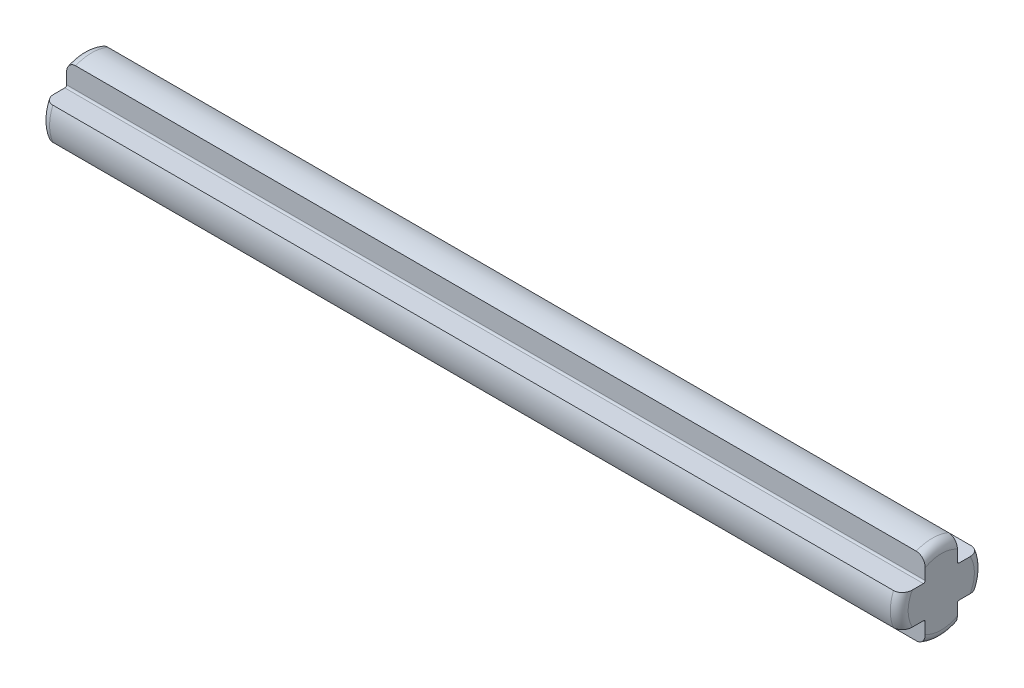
ISO-10303-21;
HEADER;
FILE_DESCRIPTION(('STEP AP214'),'2;1');
FILE_NAME('part.step','',(''),(''),'','','');
FILE_SCHEMA(('AUTOMOTIVE_DESIGN { 1 0 10303 214 1 1 1 1 }'));
ENDSEC;
DATA;
#1=APPLICATION_CONTEXT('core data for automotive mechanical design processes');
#2=APPLICATION_PROTOCOL_DEFINITION('international standard','automotive_design',2000,#1);
#3=PRODUCT_CONTEXT('',#1,'mechanical');
#4=PRODUCT('Part','Part','',(#3));
#5=PRODUCT_RELATED_PRODUCT_CATEGORY('part','',(#4));
#6=PRODUCT_DEFINITION_FORMATION('','',#4);
#7=PRODUCT_DEFINITION_CONTEXT('part definition',#1,'design');
#8=PRODUCT_DEFINITION('design','',#6,#7);
#9=PRODUCT_DEFINITION_SHAPE('','',#8);
#10=(LENGTH_UNIT() NAMED_UNIT(*) SI_UNIT(.MILLI.,.METRE.));
#11=(NAMED_UNIT(*) PLANE_ANGLE_UNIT() SI_UNIT($,.RADIAN.));
#12=(NAMED_UNIT(*) SI_UNIT($,.STERADIAN.) SOLID_ANGLE_UNIT());
#13=UNCERTAINTY_MEASURE_WITH_UNIT(LENGTH_MEASURE(1.E-05),#10,'distance_accuracy_value','');
#14=(GEOMETRIC_REPRESENTATION_CONTEXT(3) GLOBAL_UNCERTAINTY_ASSIGNED_CONTEXT((#13)) GLOBAL_UNIT_ASSIGNED_CONTEXT((#10,
#11,#12)) REPRESENTATION_CONTEXT('',''));
#15=CARTESIAN_POINT('',(0.,0.,0.));
#16=DIRECTION('',(0.,0.,1.));
#17=DIRECTION('',(1.,0.,0.));
#18=AXIS2_PLACEMENT_3D('',#15,#16,#17);
#19=CARTESIAN_POINT('',(24.,0.,0.));
#20=DIRECTION('',(-1.,0.,0.));
#21=DIRECTION('',(0.,0.,1.));
#22=AXIS2_PLACEMENT_3D('',#19,#20,#21);
#23=CYLINDRICAL_SURFACE('',#22,2.35);
#24=DIRECTION('',(-1.,0.,0.));
#25=VECTOR('',#24,1.);
#26=CARTESIAN_POINT('',(24.,0.9,2.17082933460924));
#27=LINE('',#26,#25);
#28=CARTESIAN_POINT('',(23.5,0.9,2.17082933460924));
#29=VERTEX_POINT('',#28);
#30=CARTESIAN_POINT('',(-23.5,0.9,2.17082933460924));
#31=VERTEX_POINT('',#30);
#32=EDGE_CURVE('E250',#29,#31,#27,.T.);
#33=ORIENTED_EDGE('',*,*,#32,.T.);
#34=CARTESIAN_POINT('',(-23.5,0.,0.));
#35=DIRECTION('',(1.,0.,0.));
#36=DIRECTION('',(0.,0.,-1.));
#37=AXIS2_PLACEMENT_3D('',#34,#35,#36);
#38=CIRCLE('',#37,2.35);
#39=CARTESIAN_POINT('',(-23.5,-0.900000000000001,2.17082933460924));
#40=VERTEX_POINT('',#39);
#41=EDGE_CURVE('E515',#31,#40,#38,.T.);
#42=ORIENTED_EDGE('',*,*,#41,.T.);
#43=DIRECTION('',(-1.,0.,0.));
#44=VECTOR('',#43,1.);
#45=CARTESIAN_POINT('',(24.,-0.900000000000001,2.17082933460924));
#46=LINE('',#45,#44);
#47=CARTESIAN_POINT('',(23.5,-0.900000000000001,2.17082933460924));
#48=VERTEX_POINT('',#47);
#49=EDGE_CURVE('E221',#48,#40,#46,.T.);
#50=ORIENTED_EDGE('',*,*,#49,.F.);
#51=CARTESIAN_POINT('',(23.5,0.,0.));
#52=DIRECTION('',(1.,0.,0.));
#53=DIRECTION('',(0.,0.,-1.));
#54=AXIS2_PLACEMENT_3D('',#51,#52,#53);
#55=CIRCLE('',#54,2.35);
#56=EDGE_CURVE('E370',#48,#29,#55,.F.);
#57=ORIENTED_EDGE('',*,*,#56,.T.);
#58=EDGE_LOOP('',(#33,#42,#50,#57));
#59=FACE_BOUND('',#58,.T.);
#60=ADVANCED_FACE('F37',(#59),#23,.T.);
#61=CARTESIAN_POINT('',(24.,-0.900000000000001,2.17082933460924));
#62=DIRECTION('',(0.,1.,0.));
#63=DIRECTION('',(0.,0.,1.));
#64=AXIS2_PLACEMENT_3D('',#61,#62,#63);
#65=PLANE('',#64);
#66=ORIENTED_EDGE('',*,*,#49,.T.);
#67=CARTESIAN_POINT('',(-23.5,-0.900000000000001,2.17082933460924));
#68=CARTESIAN_POINT('',(-23.5264833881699,-0.900000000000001,2.17085986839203));
#69=CARTESIAN_POINT('',(-23.5529498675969,-0.900000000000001,2.16855372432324));
#70=CARTESIAN_POINT('',(-23.6050453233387,-0.900000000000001,2.15950506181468));
#71=CARTESIAN_POINT('',(-23.6306762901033,-0.900000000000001,2.15277404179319));
#72=CARTESIAN_POINT('',(-23.6804387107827,-0.900000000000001,2.1351114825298));
#73=CARTESIAN_POINT('',(-23.7045703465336,-0.900000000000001,2.12418045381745));
#74=CARTESIAN_POINT('',(-23.7507251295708,-0.900000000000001,2.09852306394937));
#75=CARTESIAN_POINT('',(-23.7727475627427,-0.900000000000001,2.0837954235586));
#76=CARTESIAN_POINT('',(-23.8147234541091,-0.900000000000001,2.05060839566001));
#77=CARTESIAN_POINT('',(-23.8346070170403,-0.900000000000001,2.03206082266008));
#78=CARTESIAN_POINT('',(-23.8712243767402,-0.900000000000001,1.99209288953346));
#79=CARTESIAN_POINT('',(-23.8879579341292,-0.900000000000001,1.97067231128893));
#80=CARTESIAN_POINT('',(-23.9190973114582,-0.900000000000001,1.92396602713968));
#81=CARTESIAN_POINT('',(-23.9332527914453,-0.900000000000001,1.89851375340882));
#82=CARTESIAN_POINT('',(-23.9575247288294,-0.900000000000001,1.84573102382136));
#83=CARTESIAN_POINT('',(-23.9676367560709,-0.900000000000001,1.81839854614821));
#84=CARTESIAN_POINT('',(-23.9838866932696,-0.900000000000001,1.76219756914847));
#85=CARTESIAN_POINT('',(-23.9899702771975,-0.900000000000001,1.73331353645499));
#86=CARTESIAN_POINT('',(-23.9980270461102,-0.900000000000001,1.67505065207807));
#87=CARTESIAN_POINT('',(-24.0000109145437,-0.900000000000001,1.64567328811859));
#88=CARTESIAN_POINT('',(-24.,-0.900000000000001,1.61632298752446));
#89=B_SPLINE_CURVE_WITH_KNOTS('',3,(#67,#68,#69,#70,#71,#72,#73,#74,#75,#76,#77,#78,#79,#80,#81,
#82,#83,#84,#85,#86,#87,#88),.UNSPECIFIED.,.F.,.F.,(4,2,2,2,2,2,2,2,2,2,4),(0.,
0.0793238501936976,0.158442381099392,0.237551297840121,0.316686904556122,0.397909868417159,
0.479139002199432,0.566147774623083,0.653251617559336,0.741507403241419,0.829532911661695),.UNSPECIFIED.);
#90=CARTESIAN_POINT('',(-24.,-0.900000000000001,1.61632298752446));
#91=VERTEX_POINT('',#90);
#92=EDGE_CURVE('E390',#40,#91,#89,.T.);
#93=ORIENTED_EDGE('',*,*,#92,.T.);
#94=DIRECTION('',(0.,0.,-1.));
#95=VECTOR('',#94,1.);
#96=CARTESIAN_POINT('',(-24.,-0.900000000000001,2.17082933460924));
#97=LINE('',#96,#95);
#98=CARTESIAN_POINT('',(-24.,-0.900000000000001,0.999999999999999));
#99=VERTEX_POINT('',#98);
#100=EDGE_CURVE('E218',#91,#99,#97,.T.);
#101=ORIENTED_EDGE('',*,*,#100,.T.);
#102=DIRECTION('',(-1.,0.,0.));
#103=VECTOR('',#102,1.);
#104=CARTESIAN_POINT('',(24.,-0.900000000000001,0.999999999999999));
#105=LINE('',#104,#103);
#106=CARTESIAN_POINT('',(24.,-0.900000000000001,0.999999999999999));
#107=VERTEX_POINT('',#106);
#108=EDGE_CURVE('E214',#107,#99,#105,.T.);
#109=ORIENTED_EDGE('',*,*,#108,.F.);
#110=DIRECTION('',(0.,0.,-1.));
#111=VECTOR('',#110,1.);
#112=CARTESIAN_POINT('',(24.,-0.900000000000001,2.17082933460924));
#113=LINE('',#112,#111);
#114=CARTESIAN_POINT('',(24.,-0.900000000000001,1.61632298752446));
#115=VERTEX_POINT('',#114);
#116=EDGE_CURVE('E201',#115,#107,#113,.T.);
#117=ORIENTED_EDGE('',*,*,#116,.F.);
#118=CARTESIAN_POINT('',(24.,-0.900000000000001,1.61632298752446));
#119=CARTESIAN_POINT('',(24.0000222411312,-0.900000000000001,1.65066661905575));
#120=CARTESIAN_POINT('',(23.9972983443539,-0.900000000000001,1.68506058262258));
#121=CARTESIAN_POINT('',(23.9862156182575,-0.900000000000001,1.75308687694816));
#122=CARTESIAN_POINT('',(23.9778303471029,-0.900000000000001,1.78671486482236));
#123=CARTESIAN_POINT('',(23.9552419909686,-0.900000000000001,1.85211366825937));
#124=CARTESIAN_POINT('',(23.9410195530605,-0.900000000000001,1.88387790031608));
#125=CARTESIAN_POINT('',(23.9069131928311,-0.900000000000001,1.94414749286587));
#126=CARTESIAN_POINT('',(23.8870416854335,-0.900000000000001,1.97265980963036));
#127=CARTESIAN_POINT('',(23.844222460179,-0.900000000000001,2.02268935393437));
#128=CARTESIAN_POINT('',(23.8217526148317,-0.900000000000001,2.04461521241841));
#129=CARTESIAN_POINT('',(23.7730890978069,-0.900000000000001,2.08389547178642));
#130=CARTESIAN_POINT('',(23.7468952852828,-0.900000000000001,2.10124969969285));
#131=CARTESIAN_POINT('',(23.6943438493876,-0.900000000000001,2.12912089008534));
#132=CARTESIAN_POINT('',(23.6682509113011,-0.900000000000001,2.14013932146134));
#133=CARTESIAN_POINT('',(23.6145341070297,-0.900000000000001,2.15730052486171));
#134=CARTESIAN_POINT('',(23.586913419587,-0.900000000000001,2.1634530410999));
#135=CARTESIAN_POINT('',(23.5492135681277,-0.900000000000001,2.16830749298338));
#136=CARTESIAN_POINT('',(23.5393866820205,-0.900000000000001,2.1692533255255));
#137=CARTESIAN_POINT('',(23.5197081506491,-0.900000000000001,2.17051341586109));
#138=CARTESIAN_POINT('',(23.5098565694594,-0.900000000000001,2.17082867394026));
#139=CARTESIAN_POINT('',(23.5,-0.900000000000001,2.17082933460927));
#140=B_SPLINE_CURVE_WITH_KNOTS('',3,(#118,#119,#120,#121,#122,#123,#124,#125,#126,#127,#128,
#129,#130,#131,#132,#133,#134,#135,#136,#137,#138,#139),.UNSPECIFIED.,.F.,.F.,(4,2,2,2,2,2,2,2,
2,2,4),(0.,0.10300027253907,0.206484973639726,0.31031558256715,0.413919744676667,
0.507586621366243,0.60125704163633,0.685799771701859,0.770172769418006,0.79977449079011,
0.829329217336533),.UNSPECIFIED.);
#141=EDGE_CURVE('E520',#115,#48,#140,.T.);
#142=ORIENTED_EDGE('',*,*,#141,.T.);
#143=EDGE_LOOP('',(#66,#93,#101,#109,#117,#142));
#144=FACE_BOUND('',#143,.T.);
#145=ADVANCED_FACE('F216',(#144),#65,.F.);
#146=CARTESIAN_POINT('',(24.,-1.,0.999999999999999));
#147=DIRECTION('',(-1.,0.,0.));
#148=DIRECTION('',(0.,0.,1.));
#149=AXIS2_PLACEMENT_3D('',#146,#147,#148);
#150=CYLINDRICAL_SURFACE('',#149,0.0999999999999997);
#151=CARTESIAN_POINT('',(-24.,-1.,0.999999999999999));
#152=DIRECTION('',(-1.,0.,0.));
#153=DIRECTION('',(0.,0.,1.));
#154=AXIS2_PLACEMENT_3D('',#151,#152,#153);
#155=CIRCLE('',#154,0.0999999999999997);
#156=CARTESIAN_POINT('',(-24.,-1.,0.899999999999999));
#157=VERTEX_POINT('',#156);
#158=EDGE_CURVE('E252',#99,#157,#155,.T.);
#159=ORIENTED_EDGE('',*,*,#158,.T.);
#160=DIRECTION('',(-1.,0.,0.));
#161=VECTOR('',#160,1.);
#162=CARTESIAN_POINT('',(24.,-1.,0.899999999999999));
#163=LINE('',#162,#161);
#164=CARTESIAN_POINT('',(24.,-1.,0.899999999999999));
#165=VERTEX_POINT('',#164);
#166=EDGE_CURVE('E222',#165,#157,#163,.T.);
#167=ORIENTED_EDGE('',*,*,#166,.F.);
#168=CARTESIAN_POINT('',(24.,-1.,0.999999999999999));
#169=DIRECTION('',(-1.,0.,0.));
#170=DIRECTION('',(0.,0.,1.));
#171=AXIS2_PLACEMENT_3D('',#168,#169,#170);
#172=CIRCLE('',#171,0.0999999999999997);
#173=EDGE_CURVE('E207',#107,#165,#172,.T.);
#174=ORIENTED_EDGE('',*,*,#173,.F.);
#175=ORIENTED_EDGE('',*,*,#108,.T.);
#176=EDGE_LOOP('',(#159,#167,#174,#175));
#177=FACE_BOUND('',#176,.T.);
#178=ADVANCED_FACE('F224',(#177),#150,.F.);
#179=CARTESIAN_POINT('',(24.,-2.17082933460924,0.899999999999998));
#180=DIRECTION('',(0.,0.,-1.));
#181=DIRECTION('',(0.,1.,0.));
#182=AXIS2_PLACEMENT_3D('',#179,#180,#181);
#183=PLANE('',#182);
#184=DIRECTION('',(0.,-1.,0.));
#185=VECTOR('',#184,1.);
#186=CARTESIAN_POINT('',(-24.,-2.17082933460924,0.899999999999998));
#187=LINE('',#186,#185);
#188=CARTESIAN_POINT('',(-24.,-1.61632298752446,0.899999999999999));
#189=VERTEX_POINT('',#188);
#190=EDGE_CURVE('E254',#157,#189,#187,.T.);
#191=ORIENTED_EDGE('',*,*,#190,.T.);
#192=CARTESIAN_POINT('',(-24.,-1.61632298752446,0.899999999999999));
#193=CARTESIAN_POINT('',(-24.0000222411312,-1.65066661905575,0.899999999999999));
#194=CARTESIAN_POINT('',(-23.9972983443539,-1.68506058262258,0.899999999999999));
#195=CARTESIAN_POINT('',(-23.9862156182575,-1.75308687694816,0.899999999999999));
#196=CARTESIAN_POINT('',(-23.9778303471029,-1.78671486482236,0.899999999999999));
#197=CARTESIAN_POINT('',(-23.9552419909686,-1.85211366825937,0.899999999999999));
#198=CARTESIAN_POINT('',(-23.9410195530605,-1.88387790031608,0.899999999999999));
#199=CARTESIAN_POINT('',(-23.9069131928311,-1.94414749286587,0.899999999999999));
#200=CARTESIAN_POINT('',(-23.8870416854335,-1.97265980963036,0.899999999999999));
#201=CARTESIAN_POINT('',(-23.844222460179,-2.02268935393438,0.899999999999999));
#202=CARTESIAN_POINT('',(-23.8217526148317,-2.04461521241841,0.899999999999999));
#203=CARTESIAN_POINT('',(-23.7730890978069,-2.08389547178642,0.899999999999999));
#204=CARTESIAN_POINT('',(-23.7468952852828,-2.10124969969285,0.899999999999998));
#205=CARTESIAN_POINT('',(-23.6943438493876,-2.12912089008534,0.899999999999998));
#206=CARTESIAN_POINT('',(-23.6682509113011,-2.14013932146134,0.899999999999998));
#207=CARTESIAN_POINT('',(-23.6145341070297,-2.15730052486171,0.899999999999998));
#208=CARTESIAN_POINT('',(-23.586913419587,-2.1634530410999,0.899999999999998));
#209=CARTESIAN_POINT('',(-23.5492135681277,-2.16830749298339,0.899999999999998));
#210=CARTESIAN_POINT('',(-23.5393866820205,-2.1692533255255,0.899999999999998));
#211=CARTESIAN_POINT('',(-23.5197081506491,-2.17051341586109,0.899999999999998));
#212=CARTESIAN_POINT('',(-23.5098565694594,-2.17082867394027,0.899999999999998));
#213=CARTESIAN_POINT('',(-23.5,-2.17082933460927,0.899999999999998));
#214=B_SPLINE_CURVE_WITH_KNOTS('',3,(#192,#193,#194,#195,#196,#197,#198,#199,#200,#201,#202,
#203,#204,#205,#206,#207,#208,#209,#210,#211,#212,#213),.UNSPECIFIED.,.F.,.F.,(4,2,2,2,2,2,2,2,
2,2,4),(0.,0.10300027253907,0.206484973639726,0.310315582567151,0.413919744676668,
0.507586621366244,0.60125704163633,0.685799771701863,0.770172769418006,0.79977449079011,
0.829329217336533),.UNSPECIFIED.);
#215=CARTESIAN_POINT('',(-23.5,-2.17082933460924,0.899999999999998));
#216=VERTEX_POINT('',#215);
#217=EDGE_CURVE('E365',#189,#216,#214,.T.);
#218=ORIENTED_EDGE('',*,*,#217,.T.);
#219=DIRECTION('',(-1.,0.,0.));
#220=VECTOR('',#219,1.);
#221=CARTESIAN_POINT('',(24.,-2.17082933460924,0.899999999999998));
#222=LINE('',#221,#220);
#223=CARTESIAN_POINT('',(23.5,-2.17082933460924,0.899999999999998));
#224=VERTEX_POINT('',#223);
#225=EDGE_CURVE('E312',#224,#216,#222,.T.);
#226=ORIENTED_EDGE('',*,*,#225,.F.);
#227=CARTESIAN_POINT('',(23.5,-2.17082933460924,0.899999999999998));
#228=CARTESIAN_POINT('',(23.5264833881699,-2.17085986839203,0.899999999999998));
#229=CARTESIAN_POINT('',(23.5529498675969,-2.16855372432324,0.899999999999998));
#230=CARTESIAN_POINT('',(23.6050453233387,-2.15950506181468,0.899999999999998));
#231=CARTESIAN_POINT('',(23.6306762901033,-2.15277404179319,0.899999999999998));
#232=CARTESIAN_POINT('',(23.6804387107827,-2.1351114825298,0.899999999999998));
#233=CARTESIAN_POINT('',(23.7045703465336,-2.12418045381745,0.899999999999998));
#234=CARTESIAN_POINT('',(23.7507251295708,-2.09852306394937,0.899999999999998));
#235=CARTESIAN_POINT('',(23.7727475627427,-2.0837954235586,0.899999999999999));
#236=CARTESIAN_POINT('',(23.8147234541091,-2.05060839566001,0.899999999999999));
#237=CARTESIAN_POINT('',(23.8346070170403,-2.03206082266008,0.899999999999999));
#238=CARTESIAN_POINT('',(23.8712243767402,-1.99209288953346,0.899999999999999));
#239=CARTESIAN_POINT('',(23.8879579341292,-1.97067231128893,0.899999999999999));
#240=CARTESIAN_POINT('',(23.9190973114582,-1.92396602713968,0.899999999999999));
#241=CARTESIAN_POINT('',(23.9332527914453,-1.89851375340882,0.899999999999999));
#242=CARTESIAN_POINT('',(23.9575247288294,-1.84573102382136,0.899999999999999));
#243=CARTESIAN_POINT('',(23.9676367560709,-1.81839854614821,0.899999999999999));
#244=CARTESIAN_POINT('',(23.9838866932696,-1.76219756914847,0.899999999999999));
#245=CARTESIAN_POINT('',(23.9899702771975,-1.733313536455,0.899999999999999));
#246=CARTESIAN_POINT('',(23.9980270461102,-1.67505065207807,0.899999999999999));
#247=CARTESIAN_POINT('',(24.0000109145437,-1.64567328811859,0.899999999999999));
#248=CARTESIAN_POINT('',(24.,-1.61632298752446,0.899999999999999));
#249=B_SPLINE_CURVE_WITH_KNOTS('',3,(#227,#228,#229,#230,#231,#232,#233,#234,#235,#236,#237,
#238,#239,#240,#241,#242,#243,#244,#245,#246,#247,#248),.UNSPECIFIED.,.F.,.F.,(4,2,2,2,2,2,2,2,
2,2,4),(0.,0.0793238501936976,0.158442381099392,0.237551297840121,0.316686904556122,
0.397909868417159,0.479139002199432,0.566147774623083,0.653251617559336,0.741507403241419,
0.829532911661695),.UNSPECIFIED.);
#250=CARTESIAN_POINT('',(24.,-1.61632298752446,0.899999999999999));
#251=VERTEX_POINT('',#250);
#252=EDGE_CURVE('E359',#224,#251,#249,.T.);
#253=ORIENTED_EDGE('',*,*,#252,.T.);
#254=DIRECTION('',(0.,-1.,0.));
#255=VECTOR('',#254,1.);
#256=CARTESIAN_POINT('',(24.,-2.17082933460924,0.899999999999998));
#257=LINE('',#256,#255);
#258=EDGE_CURVE('E227',#165,#251,#257,.T.);
#259=ORIENTED_EDGE('',*,*,#258,.F.);
#260=ORIENTED_EDGE('',*,*,#166,.T.);
#261=EDGE_LOOP('',(#191,#218,#226,#253,#259,#260));
#262=FACE_BOUND('',#261,.T.);
#263=ADVANCED_FACE('F350',(#262),#183,.F.);
#264=CARTESIAN_POINT('',(24.,0.,0.));
#265=DIRECTION('',(-1.,0.,0.));
#266=DIRECTION('',(0.,0.,1.));
#267=AXIS2_PLACEMENT_3D('',#264,#265,#266);
#268=CYLINDRICAL_SURFACE('',#267,2.35);
#269=ORIENTED_EDGE('',*,*,#225,.T.);
#270=CARTESIAN_POINT('',(-23.5,0.,0.));
#271=DIRECTION('',(1.,0.,0.));
#272=DIRECTION('',(0.,0.,-1.));
#273=AXIS2_PLACEMENT_3D('',#270,#271,#272);
#274=CIRCLE('',#273,2.35);
#275=CARTESIAN_POINT('',(-23.5,-2.17082933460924,-0.9));
#276=VERTEX_POINT('',#275);
#277=EDGE_CURVE('E319',#216,#276,#274,.T.);
#278=ORIENTED_EDGE('',*,*,#277,.T.);
#279=DIRECTION('',(-1.,0.,0.));
#280=VECTOR('',#279,1.);
#281=CARTESIAN_POINT('',(24.,-2.17082933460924,-0.9));
#282=LINE('',#281,#280);
#283=CARTESIAN_POINT('',(23.5,-2.17082933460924,-0.9));
#284=VERTEX_POINT('',#283);
#285=EDGE_CURVE('E309',#284,#276,#282,.T.);
#286=ORIENTED_EDGE('',*,*,#285,.F.);
#287=CARTESIAN_POINT('',(23.5,0.,0.));
#288=DIRECTION('',(1.,0.,0.));
#289=DIRECTION('',(0.,0.,-1.));
#290=AXIS2_PLACEMENT_3D('',#287,#288,#289);
#291=CIRCLE('',#290,2.35);
#292=EDGE_CURVE('E317',#284,#224,#291,.F.);
#293=ORIENTED_EDGE('',*,*,#292,.T.);
#294=EDGE_LOOP('',(#269,#278,#286,#293));
#295=FACE_BOUND('',#294,.T.);
#296=ADVANCED_FACE('F344',(#295),#268,.T.);
#297=CARTESIAN_POINT('',(24.,-2.17082933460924,-0.9));
#298=DIRECTION('',(0.,0.,1.));
#299=DIRECTION('',(0.,-1.,0.));
#300=AXIS2_PLACEMENT_3D('',#297,#298,#299);
#301=PLANE('',#300);
#302=ORIENTED_EDGE('',*,*,#285,.T.);
#303=CARTESIAN_POINT('',(-23.5,-2.17082933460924,-0.9));
#304=CARTESIAN_POINT('',(-23.5264833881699,-2.17085986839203,-0.9));
#305=CARTESIAN_POINT('',(-23.5529498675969,-2.16855372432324,-0.9));
#306=CARTESIAN_POINT('',(-23.6050453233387,-2.15950506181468,-0.9));
#307=CARTESIAN_POINT('',(-23.6306762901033,-2.15277404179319,-0.9));
#308=CARTESIAN_POINT('',(-23.6804387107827,-2.1351114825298,-0.9));
#309=CARTESIAN_POINT('',(-23.7045703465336,-2.12418045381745,-0.9));
#310=CARTESIAN_POINT('',(-23.7507251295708,-2.09852306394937,-0.9));
#311=CARTESIAN_POINT('',(-23.7727475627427,-2.0837954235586,-0.9));
#312=CARTESIAN_POINT('',(-23.8147234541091,-2.05060839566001,-0.9));
#313=CARTESIAN_POINT('',(-23.8346070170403,-2.03206082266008,-0.9));
#314=CARTESIAN_POINT('',(-23.8712243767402,-1.99209288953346,-0.9));
#315=CARTESIAN_POINT('',(-23.8879579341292,-1.97067231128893,-0.9));
#316=CARTESIAN_POINT('',(-23.9190973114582,-1.92396602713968,-0.9));
#317=CARTESIAN_POINT('',(-23.9332527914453,-1.89851375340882,-0.9));
#318=CARTESIAN_POINT('',(-23.9575247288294,-1.84573102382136,-0.9));
#319=CARTESIAN_POINT('',(-23.9676367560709,-1.81839854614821,-0.9));
#320=CARTESIAN_POINT('',(-23.9838866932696,-1.76219756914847,-0.9));
#321=CARTESIAN_POINT('',(-23.9899702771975,-1.733313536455,-0.9));
#322=CARTESIAN_POINT('',(-23.9980270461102,-1.67505065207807,-0.9));
#323=CARTESIAN_POINT('',(-24.0000109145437,-1.64567328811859,-0.9));
#324=CARTESIAN_POINT('',(-24.,-1.61632298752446,-0.9));
#325=B_SPLINE_CURVE_WITH_KNOTS('',3,(#303,#304,#305,#306,#307,#308,#309,#310,#311,#312,#313,
#314,#315,#316,#317,#318,#319,#320,#321,#322,#323,#324),.UNSPECIFIED.,.F.,.F.,(4,2,2,2,2,2,2,2,
2,2,4),(0.,0.0793238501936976,0.158442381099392,0.237551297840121,0.316686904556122,
0.397909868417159,0.479139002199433,0.566147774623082,0.653251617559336,0.741507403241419,
0.829532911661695),.UNSPECIFIED.);
#326=CARTESIAN_POINT('',(-24.,-1.61632298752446,-0.9));
#327=VERTEX_POINT('',#326);
#328=EDGE_CURVE('E329',#276,#327,#325,.T.);
#329=ORIENTED_EDGE('',*,*,#328,.T.);
#330=DIRECTION('',(0.,1.,0.));
#331=VECTOR('',#330,1.);
#332=CARTESIAN_POINT('',(-24.,-2.17082933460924,-0.9));
#333=LINE('',#332,#331);
#334=CARTESIAN_POINT('',(-24.,-1.,-0.9));
#335=VERTEX_POINT('',#334);
#336=EDGE_CURVE('E257',#327,#335,#333,.T.);
#337=ORIENTED_EDGE('',*,*,#336,.T.);
#338=DIRECTION('',(-1.,0.,0.));
#339=VECTOR('',#338,1.);
#340=CARTESIAN_POINT('',(24.,-1.,-0.9));
#341=LINE('',#340,#339);
#342=CARTESIAN_POINT('',(24.,-1.,-0.9));
#343=VERTEX_POINT('',#342);
#344=EDGE_CURVE('E306',#343,#335,#341,.T.);
#345=ORIENTED_EDGE('',*,*,#344,.F.);
#346=DIRECTION('',(0.,1.,0.));
#347=VECTOR('',#346,1.);
#348=CARTESIAN_POINT('',(24.,-2.17082933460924,-0.9));
#349=LINE('',#348,#347);
#350=CARTESIAN_POINT('',(24.,-1.61632298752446,-0.9));
#351=VERTEX_POINT('',#350);
#352=EDGE_CURVE('E229',#351,#343,#349,.T.);
#353=ORIENTED_EDGE('',*,*,#352,.F.);
#354=CARTESIAN_POINT('',(24.,-1.61632298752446,-0.9));
#355=CARTESIAN_POINT('',(24.0000222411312,-1.65066661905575,-0.9));
#356=CARTESIAN_POINT('',(23.9972983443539,-1.68506058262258,-0.9));
#357=CARTESIAN_POINT('',(23.9862156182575,-1.75308687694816,-0.9));
#358=CARTESIAN_POINT('',(23.9778303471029,-1.78671486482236,-0.9));
#359=CARTESIAN_POINT('',(23.9552419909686,-1.85211366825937,-0.9));
#360=CARTESIAN_POINT('',(23.9410195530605,-1.88387790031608,-0.9));
#361=CARTESIAN_POINT('',(23.9069131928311,-1.94414749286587,-0.9));
#362=CARTESIAN_POINT('',(23.8870416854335,-1.97265980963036,-0.9));
#363=CARTESIAN_POINT('',(23.844222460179,-2.02268935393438,-0.9));
#364=CARTESIAN_POINT('',(23.8217526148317,-2.04461521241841,-0.9));
#365=CARTESIAN_POINT('',(23.7730890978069,-2.08389547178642,-0.9));
#366=CARTESIAN_POINT('',(23.7468952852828,-2.10124969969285,-0.9));
#367=CARTESIAN_POINT('',(23.6943438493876,-2.12912089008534,-0.9));
#368=CARTESIAN_POINT('',(23.6682509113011,-2.14013932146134,-0.9));
#369=CARTESIAN_POINT('',(23.6145341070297,-2.15730052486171,-0.9));
#370=CARTESIAN_POINT('',(23.586913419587,-2.1634530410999,-0.9));
#371=CARTESIAN_POINT('',(23.5492135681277,-2.16830749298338,-0.9));
#372=CARTESIAN_POINT('',(23.5393866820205,-2.1692533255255,-0.9));
#373=CARTESIAN_POINT('',(23.5197081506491,-2.17051341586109,-0.9));
#374=CARTESIAN_POINT('',(23.5098565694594,-2.17082867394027,-0.9));
#375=CARTESIAN_POINT('',(23.5,-2.17082933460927,-0.9));
#376=B_SPLINE_CURVE_WITH_KNOTS('',3,(#354,#355,#356,#357,#358,#359,#360,#361,#362,#363,#364,
#365,#366,#367,#368,#369,#370,#371,#372,#373,#374,#375),.UNSPECIFIED.,.F.,.F.,(4,2,2,2,2,2,2,2,
2,2,4),(0.,0.10300027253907,0.206484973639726,0.310315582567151,0.413919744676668,
0.507586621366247,0.601257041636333,0.685799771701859,0.770172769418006,0.79977449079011,
0.829329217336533),.UNSPECIFIED.);
#377=EDGE_CURVE('E322',#351,#284,#376,.T.);
#378=ORIENTED_EDGE('',*,*,#377,.T.);
#379=EDGE_LOOP('',(#302,#329,#337,#345,#353,#378));
#380=FACE_BOUND('',#379,.T.);
#381=ADVANCED_FACE('F338',(#380),#301,.F.);
#382=CARTESIAN_POINT('',(24.,-1.,-1.));
#383=DIRECTION('',(-1.,0.,0.));
#384=DIRECTION('',(0.,0.,1.));
#385=AXIS2_PLACEMENT_3D('',#382,#383,#384);
#386=CYLINDRICAL_SURFACE('',#385,0.0999999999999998);
#387=CARTESIAN_POINT('',(-24.,-1.,-1.));
#388=DIRECTION('',(-1.,0.,0.));
#389=DIRECTION('',(0.,0.,-1.));
#390=AXIS2_PLACEMENT_3D('',#387,#388,#389);
#391=CIRCLE('',#390,0.0999999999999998);
#392=CARTESIAN_POINT('',(-24.,-0.9,-1.));
#393=VERTEX_POINT('',#392);
#394=EDGE_CURVE('E259',#335,#393,#391,.T.);
#395=ORIENTED_EDGE('',*,*,#394,.T.);
#396=DIRECTION('',(-1.,0.,0.));
#397=VECTOR('',#396,1.);
#398=CARTESIAN_POINT('',(24.,-0.9,-1.));
#399=LINE('',#398,#397);
#400=CARTESIAN_POINT('',(24.,-0.9,-1.));
#401=VERTEX_POINT('',#400);
#402=EDGE_CURVE('E303',#401,#393,#399,.T.);
#403=ORIENTED_EDGE('',*,*,#402,.F.);
#404=CARTESIAN_POINT('',(24.,-1.,-1.));
#405=DIRECTION('',(-1.,0.,0.));
#406=DIRECTION('',(0.,0.,-1.));
#407=AXIS2_PLACEMENT_3D('',#404,#405,#406);
#408=CIRCLE('',#407,0.0999999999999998);
#409=EDGE_CURVE('E233',#343,#401,#408,.T.);
#410=ORIENTED_EDGE('',*,*,#409,.F.);
#411=ORIENTED_EDGE('',*,*,#344,.T.);
#412=EDGE_LOOP('',(#395,#403,#410,#411));
#413=FACE_BOUND('',#412,.T.);
#414=ADVANCED_FACE('F343',(#413),#386,.F.);
#415=CARTESIAN_POINT('',(24.,-0.900000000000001,-2.17082933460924));
#416=DIRECTION('',(0.,1.,0.));
#417=DIRECTION('',(0.,0.,1.));
#418=AXIS2_PLACEMENT_3D('',#415,#416,#417);
#419=PLANE('',#418);
#420=DIRECTION('',(0.,0.,-1.));
#421=VECTOR('',#420,1.);
#422=CARTESIAN_POINT('',(-24.,-0.900000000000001,-2.17082933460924));
#423=LINE('',#422,#421);
#424=CARTESIAN_POINT('',(-24.,-0.9,-1.61632298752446));
#425=VERTEX_POINT('',#424);
#426=EDGE_CURVE('E261',#393,#425,#423,.T.);
#427=ORIENTED_EDGE('',*,*,#426,.T.);
#428=CARTESIAN_POINT('',(-24.,-0.9,-1.61632298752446));
#429=CARTESIAN_POINT('',(-24.0000222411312,-0.9,-1.65066661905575));
#430=CARTESIAN_POINT('',(-23.9972983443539,-0.9,-1.68506058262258));
#431=CARTESIAN_POINT('',(-23.9862156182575,-0.9,-1.75308687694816));
#432=CARTESIAN_POINT('',(-23.9778303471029,-0.9,-1.78671486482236));
#433=CARTESIAN_POINT('',(-23.9552419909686,-0.9,-1.85211366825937));
#434=CARTESIAN_POINT('',(-23.9410195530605,-0.9,-1.88387790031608));
#435=CARTESIAN_POINT('',(-23.9069131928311,-0.9,-1.94414749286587));
#436=CARTESIAN_POINT('',(-23.8870416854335,-0.9,-1.97265980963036));
#437=CARTESIAN_POINT('',(-23.844222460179,-0.9,-2.02268935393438));
#438=CARTESIAN_POINT('',(-23.8217526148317,-0.900000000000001,-2.04461521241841));
#439=CARTESIAN_POINT('',(-23.7730890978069,-0.900000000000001,-2.08389547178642));
#440=CARTESIAN_POINT('',(-23.7468952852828,-0.900000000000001,-2.10124969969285));
#441=CARTESIAN_POINT('',(-23.6943438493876,-0.900000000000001,-2.12912089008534));
#442=CARTESIAN_POINT('',(-23.6682509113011,-0.900000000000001,-2.14013932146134));
#443=CARTESIAN_POINT('',(-23.6145341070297,-0.900000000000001,-2.15730052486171));
#444=CARTESIAN_POINT('',(-23.586913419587,-0.900000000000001,-2.1634530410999));
#445=CARTESIAN_POINT('',(-23.5492135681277,-0.900000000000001,-2.16830749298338));
#446=CARTESIAN_POINT('',(-23.5393866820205,-0.900000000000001,-2.1692533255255));
#447=CARTESIAN_POINT('',(-23.5197081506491,-0.900000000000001,-2.17051341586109));
#448=CARTESIAN_POINT('',(-23.5098565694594,-0.900000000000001,-2.17082867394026));
#449=CARTESIAN_POINT('',(-23.5,-0.900000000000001,-2.17082933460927));
#450=B_SPLINE_CURVE_WITH_KNOTS('',3,(#428,#429,#430,#431,#432,#433,#434,#435,#436,#437,#438,
#439,#440,#441,#442,#443,#444,#445,#446,#447,#448,#449),.UNSPECIFIED.,.F.,.F.,(4,2,2,2,2,2,2,2,
2,2,4),(0.,0.10300027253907,0.206484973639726,0.31031558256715,0.413919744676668,
0.50758662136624,0.60125704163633,0.685799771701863,0.770172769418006,0.79977449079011,
0.829329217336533),.UNSPECIFIED.);
#451=CARTESIAN_POINT('',(-23.5,-0.9,-2.17082933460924));
#452=VERTEX_POINT('',#451);
#453=EDGE_CURVE('E489',#425,#452,#450,.T.);
#454=ORIENTED_EDGE('',*,*,#453,.T.);
#455=DIRECTION('',(-1.,0.,0.));
#456=VECTOR('',#455,1.);
#457=CARTESIAN_POINT('',(24.,-0.9,-2.17082933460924));
#458=LINE('',#457,#456);
#459=CARTESIAN_POINT('',(23.5,-0.9,-2.17082933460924));
#460=VERTEX_POINT('',#459);
#461=EDGE_CURVE('E300',#460,#452,#458,.T.);
#462=ORIENTED_EDGE('',*,*,#461,.F.);
#463=CARTESIAN_POINT('',(23.5,-0.9,-2.17082933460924));
#464=CARTESIAN_POINT('',(23.5264833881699,-0.9,-2.17085986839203));
#465=CARTESIAN_POINT('',(23.5529498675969,-0.900000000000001,-2.16855372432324));
#466=CARTESIAN_POINT('',(23.6050453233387,-0.900000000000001,-2.15950506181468));
#467=CARTESIAN_POINT('',(23.6306762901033,-0.900000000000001,-2.15277404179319));
#468=CARTESIAN_POINT('',(23.6804387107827,-0.900000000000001,-2.1351114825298));
#469=CARTESIAN_POINT('',(23.7045703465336,-0.900000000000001,-2.12418045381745));
#470=CARTESIAN_POINT('',(23.7507251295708,-0.900000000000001,-2.09852306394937));
#471=CARTESIAN_POINT('',(23.7727475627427,-0.900000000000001,-2.0837954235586));
#472=CARTESIAN_POINT('',(23.8147234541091,-0.900000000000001,-2.05060839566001));
#473=CARTESIAN_POINT('',(23.8346070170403,-0.9,-2.03206082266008));
#474=CARTESIAN_POINT('',(23.8712243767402,-0.9,-1.99209288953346));
#475=CARTESIAN_POINT('',(23.8879579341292,-0.9,-1.97067231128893));
#476=CARTESIAN_POINT('',(23.9190973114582,-0.9,-1.92396602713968));
#477=CARTESIAN_POINT('',(23.9332527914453,-0.9,-1.89851375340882));
#478=CARTESIAN_POINT('',(23.9575247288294,-0.9,-1.84573102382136));
#479=CARTESIAN_POINT('',(23.9676367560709,-0.9,-1.81839854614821));
#480=CARTESIAN_POINT('',(23.9838866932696,-0.9,-1.76219756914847));
#481=CARTESIAN_POINT('',(23.9899702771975,-0.9,-1.733313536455));
#482=CARTESIAN_POINT('',(23.9980270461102,-0.9,-1.67505065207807));
#483=CARTESIAN_POINT('',(24.0000109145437,-0.9,-1.64567328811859));
#484=CARTESIAN_POINT('',(24.,-0.9,-1.61632298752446));
#485=B_SPLINE_CURVE_WITH_KNOTS('',3,(#463,#464,#465,#466,#467,#468,#469,#470,#471,#472,#473,
#474,#475,#476,#477,#478,#479,#480,#481,#482,#483,#484),.UNSPECIFIED.,.F.,.F.,(4,2,2,2,2,2,2,2,
2,2,4),(0.,0.0793238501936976,0.158442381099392,0.237551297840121,0.316686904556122,
0.39790986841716,0.479139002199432,0.566147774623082,0.653251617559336,0.741507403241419,
0.829532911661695),.UNSPECIFIED.);
#486=CARTESIAN_POINT('',(24.,-0.9,-1.61632298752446));
#487=VERTEX_POINT('',#486);
#488=EDGE_CURVE('E53',#460,#487,#485,.T.);
#489=ORIENTED_EDGE('',*,*,#488,.T.);
#490=DIRECTION('',(0.,0.,-1.));
#491=VECTOR('',#490,1.);
#492=CARTESIAN_POINT('',(24.,-0.900000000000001,-2.17082933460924));
#493=LINE('',#492,#491);
#494=EDGE_CURVE('E235',#401,#487,#493,.T.);
#495=ORIENTED_EDGE('',*,*,#494,.F.);
#496=ORIENTED_EDGE('',*,*,#402,.T.);
#497=EDGE_LOOP('',(#427,#454,#462,#489,#495,#496));
#498=FACE_BOUND('',#497,.T.);
#499=ADVANCED_FACE('F496',(#498),#419,.F.);
#500=CARTESIAN_POINT('',(24.,0.,0.));
#501=DIRECTION('',(-1.,0.,0.));
#502=DIRECTION('',(0.,0.,1.));
#503=AXIS2_PLACEMENT_3D('',#500,#501,#502);
#504=CYLINDRICAL_SURFACE('',#503,2.35);
#505=ORIENTED_EDGE('',*,*,#461,.T.);
#506=CARTESIAN_POINT('',(-23.5,0.,0.));
#507=DIRECTION('',(1.,0.,0.));
#508=DIRECTION('',(0.,0.,-1.));
#509=AXIS2_PLACEMENT_3D('',#506,#507,#508);
#510=CIRCLE('',#509,2.35);
#511=CARTESIAN_POINT('',(-23.5,0.900000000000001,-2.17082933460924));
#512=VERTEX_POINT('',#511);
#513=EDGE_CURVE('E575',#452,#512,#510,.T.);
#514=ORIENTED_EDGE('',*,*,#513,.T.);
#515=DIRECTION('',(-1.,0.,0.));
#516=VECTOR('',#515,1.);
#517=CARTESIAN_POINT('',(24.,0.900000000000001,-2.17082933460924));
#518=LINE('',#517,#516);
#519=CARTESIAN_POINT('',(23.5,0.900000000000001,-2.17082933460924));
#520=VERTEX_POINT('',#519);
#521=EDGE_CURVE('E297',#520,#512,#518,.T.);
#522=ORIENTED_EDGE('',*,*,#521,.F.);
#523=CARTESIAN_POINT('',(23.5,0.,0.));
#524=DIRECTION('',(1.,0.,0.));
#525=DIRECTION('',(0.,0.,-1.));
#526=AXIS2_PLACEMENT_3D('',#523,#524,#525);
#527=CIRCLE('',#526,2.35);
#528=EDGE_CURVE('E574',#520,#460,#527,.F.);
#529=ORIENTED_EDGE('',*,*,#528,.T.);
#530=EDGE_LOOP('',(#505,#514,#522,#529));
#531=FACE_BOUND('',#530,.T.);
#532=ADVANCED_FACE('F464',(#531),#504,.T.);
#533=CARTESIAN_POINT('',(24.,0.900000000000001,-2.17082933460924));
#534=DIRECTION('',(0.,-1.,0.));
#535=DIRECTION('',(0.,0.,-1.));
#536=AXIS2_PLACEMENT_3D('',#533,#534,#535);
#537=PLANE('',#536);
#538=ORIENTED_EDGE('',*,*,#521,.T.);
#539=CARTESIAN_POINT('',(-23.5,0.900000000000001,-2.17082933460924));
#540=CARTESIAN_POINT('',(-23.5264833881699,0.900000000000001,-2.17085986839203));
#541=CARTESIAN_POINT('',(-23.5529498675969,0.900000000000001,-2.16855372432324));
#542=CARTESIAN_POINT('',(-23.6050453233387,0.900000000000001,-2.15950506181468));
#543=CARTESIAN_POINT('',(-23.6306762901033,0.900000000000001,-2.15277404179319));
#544=CARTESIAN_POINT('',(-23.6804387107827,0.900000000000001,-2.1351114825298));
#545=CARTESIAN_POINT('',(-23.7045703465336,0.900000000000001,-2.12418045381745));
#546=CARTESIAN_POINT('',(-23.7507251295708,0.900000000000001,-2.09852306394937));
#547=CARTESIAN_POINT('',(-23.7727475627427,0.900000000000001,-2.0837954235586));
#548=CARTESIAN_POINT('',(-23.8147234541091,0.900000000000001,-2.05060839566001));
#549=CARTESIAN_POINT('',(-23.8346070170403,0.9,-2.03206082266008));
#550=CARTESIAN_POINT('',(-23.8712243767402,0.9,-1.99209288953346));
#551=CARTESIAN_POINT('',(-23.8879579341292,0.9,-1.97067231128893));
#552=CARTESIAN_POINT('',(-23.9190973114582,0.9,-1.92396602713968));
#553=CARTESIAN_POINT('',(-23.9332527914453,0.9,-1.89851375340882));
#554=CARTESIAN_POINT('',(-23.9575247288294,0.9,-1.84573102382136));
#555=CARTESIAN_POINT('',(-23.9676367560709,0.9,-1.81839854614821));
#556=CARTESIAN_POINT('',(-23.9838866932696,0.9,-1.76219756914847));
#557=CARTESIAN_POINT('',(-23.9899702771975,0.9,-1.733313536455));
#558=CARTESIAN_POINT('',(-23.9980270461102,0.9,-1.67505065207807));
#559=CARTESIAN_POINT('',(-24.0000109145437,0.9,-1.64567328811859));
#560=CARTESIAN_POINT('',(-24.,0.9,-1.61632298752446));
#561=B_SPLINE_CURVE_WITH_KNOTS('',3,(#539,#540,#541,#542,#543,#544,#545,#546,#547,#548,#549,
#550,#551,#552,#553,#554,#555,#556,#557,#558,#559,#560),.UNSPECIFIED.,.F.,.F.,(4,2,2,2,2,2,2,2,
2,2,4),(0.,0.0793238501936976,0.158442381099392,0.237551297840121,0.316686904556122,
0.39790986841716,0.479139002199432,0.566147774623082,0.653251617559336,0.741507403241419,
0.829532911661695),.UNSPECIFIED.);
#562=CARTESIAN_POINT('',(-24.,0.9,-1.61632298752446));
#563=VERTEX_POINT('',#562);
#564=EDGE_CURVE('E473',#512,#563,#561,.T.);
#565=ORIENTED_EDGE('',*,*,#564,.T.);
#566=DIRECTION('',(0.,0.,1.));
#567=VECTOR('',#566,1.);
#568=CARTESIAN_POINT('',(-24.,0.900000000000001,-2.17082933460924));
#569=LINE('',#568,#567);
#570=CARTESIAN_POINT('',(-24.,0.9,-1.));
#571=VERTEX_POINT('',#570);
#572=EDGE_CURVE('E264',#563,#571,#569,.T.);
#573=ORIENTED_EDGE('',*,*,#572,.T.);
#574=DIRECTION('',(-1.,0.,0.));
#575=VECTOR('',#574,1.);
#576=CARTESIAN_POINT('',(24.,0.9,-1.));
#577=LINE('',#576,#575);
#578=CARTESIAN_POINT('',(24.,0.9,-1.));
#579=VERTEX_POINT('',#578);
#580=EDGE_CURVE('E294',#579,#571,#577,.T.);
#581=ORIENTED_EDGE('',*,*,#580,.F.);
#582=DIRECTION('',(0.,0.,1.));
#583=VECTOR('',#582,1.);
#584=CARTESIAN_POINT('',(24.,0.900000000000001,-2.17082933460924));
#585=LINE('',#584,#583);
#586=CARTESIAN_POINT('',(24.,0.9,-1.61632298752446));
#587=VERTEX_POINT('',#586);
#588=EDGE_CURVE('E237',#587,#579,#585,.T.);
#589=ORIENTED_EDGE('',*,*,#588,.F.);
#590=CARTESIAN_POINT('',(24.,0.9,-1.61632298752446));
#591=CARTESIAN_POINT('',(24.0000222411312,0.9,-1.65066661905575));
#592=CARTESIAN_POINT('',(23.9972983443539,0.9,-1.68506058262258));
#593=CARTESIAN_POINT('',(23.9862156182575,0.9,-1.75308687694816));
#594=CARTESIAN_POINT('',(23.9778303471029,0.9,-1.78671486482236));
#595=CARTESIAN_POINT('',(23.9552419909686,0.9,-1.85211366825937));
#596=CARTESIAN_POINT('',(23.9410195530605,0.9,-1.88387790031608));
#597=CARTESIAN_POINT('',(23.9069131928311,0.9,-1.94414749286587));
#598=CARTESIAN_POINT('',(23.8870416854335,0.9,-1.97265980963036));
#599=CARTESIAN_POINT('',(23.844222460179,0.9,-2.02268935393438));
#600=CARTESIAN_POINT('',(23.8217526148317,0.900000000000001,-2.04461521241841));
#601=CARTESIAN_POINT('',(23.7730890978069,0.900000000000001,-2.08389547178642));
#602=CARTESIAN_POINT('',(23.7468952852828,0.900000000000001,-2.10124969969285));
#603=CARTESIAN_POINT('',(23.6943438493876,0.900000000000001,-2.12912089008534));
#604=CARTESIAN_POINT('',(23.6682509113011,0.900000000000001,-2.14013932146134));
#605=CARTESIAN_POINT('',(23.6145341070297,0.900000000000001,-2.15730052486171));
#606=CARTESIAN_POINT('',(23.586913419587,0.900000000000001,-2.1634530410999));
#607=CARTESIAN_POINT('',(23.5492135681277,0.900000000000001,-2.16830749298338));
#608=CARTESIAN_POINT('',(23.5393866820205,0.900000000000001,-2.1692533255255));
#609=CARTESIAN_POINT('',(23.5197081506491,0.900000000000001,-2.17051341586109));
#610=CARTESIAN_POINT('',(23.5098565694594,0.900000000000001,-2.17082867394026));
#611=CARTESIAN_POINT('',(23.5,0.900000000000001,-2.17082933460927));
#612=B_SPLINE_CURVE_WITH_KNOTS('',3,(#590,#591,#592,#593,#594,#595,#596,#597,#598,#599,#600,
#601,#602,#603,#604,#605,#606,#607,#608,#609,#610,#611),.UNSPECIFIED.,.F.,.F.,(4,2,2,2,2,2,2,2,
2,2,4),(0.,0.10300027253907,0.206484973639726,0.31031558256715,0.413919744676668,
0.50758662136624,0.60125704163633,0.685799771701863,0.770172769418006,0.79977449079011,
0.829329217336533),.UNSPECIFIED.);
#613=EDGE_CURVE('E61',#587,#520,#612,.T.);
#614=ORIENTED_EDGE('',*,*,#613,.T.);
#615=EDGE_LOOP('',(#538,#565,#573,#581,#589,#614));
#616=FACE_BOUND('',#615,.T.);
#617=ADVANCED_FACE('F459',(#616),#537,.F.);
#618=CARTESIAN_POINT('',(24.,1.,-1.));
#619=DIRECTION('',(-1.,0.,0.));
#620=DIRECTION('',(0.,0.,1.));
#621=AXIS2_PLACEMENT_3D('',#618,#619,#620);
#622=CYLINDRICAL_SURFACE('',#621,0.0999999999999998);
#623=CARTESIAN_POINT('',(-24.,1.,-1.));
#624=DIRECTION('',(-1.,0.,0.));
#625=DIRECTION('',(0.,0.,1.));
#626=AXIS2_PLACEMENT_3D('',#623,#624,#625);
#627=CIRCLE('',#626,0.0999999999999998);
#628=CARTESIAN_POINT('',(-24.,1.,-0.9));
#629=VERTEX_POINT('',#628);
#630=EDGE_CURVE('E266',#571,#629,#627,.T.);
#631=ORIENTED_EDGE('',*,*,#630,.T.);
#632=DIRECTION('',(-1.,0.,0.));
#633=VECTOR('',#632,1.);
#634=CARTESIAN_POINT('',(24.,1.,-0.9));
#635=LINE('',#634,#633);
#636=CARTESIAN_POINT('',(24.,1.,-0.9));
#637=VERTEX_POINT('',#636);
#638=EDGE_CURVE('E291',#637,#629,#635,.T.);
#639=ORIENTED_EDGE('',*,*,#638,.F.);
#640=CARTESIAN_POINT('',(24.,1.,-1.));
#641=DIRECTION('',(-1.,0.,0.));
#642=DIRECTION('',(0.,0.,1.));
#643=AXIS2_PLACEMENT_3D('',#640,#641,#642);
#644=CIRCLE('',#643,0.0999999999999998);
#645=EDGE_CURVE('E239',#579,#637,#644,.T.);
#646=ORIENTED_EDGE('',*,*,#645,.F.);
#647=ORIENTED_EDGE('',*,*,#580,.T.);
#648=EDGE_LOOP('',(#631,#639,#646,#647));
#649=FACE_BOUND('',#648,.T.);
#650=ADVANCED_FACE('F454',(#649),#622,.F.);
#651=CARTESIAN_POINT('',(24.,2.17082933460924,-0.9));
#652=DIRECTION('',(0.,0.,1.));
#653=DIRECTION('',(0.,-1.,0.));
#654=AXIS2_PLACEMENT_3D('',#651,#652,#653);
#655=PLANE('',#654);
#656=DIRECTION('',(0.,1.,0.));
#657=VECTOR('',#656,1.);
#658=CARTESIAN_POINT('',(-24.,2.17082933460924,-0.9));
#659=LINE('',#658,#657);
#660=CARTESIAN_POINT('',(-24.,1.61632298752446,-0.9));
#661=VERTEX_POINT('',#660);
#662=EDGE_CURVE('E268',#629,#661,#659,.T.);
#663=ORIENTED_EDGE('',*,*,#662,.T.);
#664=CARTESIAN_POINT('',(-24.,1.61632298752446,-0.9));
#665=CARTESIAN_POINT('',(-24.0000222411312,1.65066661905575,-0.9));
#666=CARTESIAN_POINT('',(-23.9972983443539,1.68506058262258,-0.9));
#667=CARTESIAN_POINT('',(-23.9862156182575,1.75308687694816,-0.9));
#668=CARTESIAN_POINT('',(-23.9778303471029,1.78671486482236,-0.9));
#669=CARTESIAN_POINT('',(-23.9552419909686,1.85211366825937,-0.9));
#670=CARTESIAN_POINT('',(-23.9410195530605,1.88387790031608,-0.9));
#671=CARTESIAN_POINT('',(-23.9069131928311,1.94414749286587,-0.9));
#672=CARTESIAN_POINT('',(-23.8870416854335,1.97265980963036,-0.9));
#673=CARTESIAN_POINT('',(-23.844222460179,2.02268935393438,-0.9));
#674=CARTESIAN_POINT('',(-23.8217526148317,2.04461521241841,-0.9));
#675=CARTESIAN_POINT('',(-23.7730890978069,2.08389547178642,-0.9));
#676=CARTESIAN_POINT('',(-23.7468952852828,2.10124969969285,-0.9));
#677=CARTESIAN_POINT('',(-23.6943438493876,2.12912089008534,-0.9));
#678=CARTESIAN_POINT('',(-23.6682509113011,2.14013932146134,-0.9));
#679=CARTESIAN_POINT('',(-23.6145341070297,2.15730052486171,-0.9));
#680=CARTESIAN_POINT('',(-23.586913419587,2.1634530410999,-0.9));
#681=CARTESIAN_POINT('',(-23.5492135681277,2.16830749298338,-0.9));
#682=CARTESIAN_POINT('',(-23.5393866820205,2.1692533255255,-0.9));
#683=CARTESIAN_POINT('',(-23.5197081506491,2.17051341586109,-0.9));
#684=CARTESIAN_POINT('',(-23.5098565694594,2.17082867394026,-0.9));
#685=CARTESIAN_POINT('',(-23.5,2.17082933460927,-0.9));
#686=B_SPLINE_CURVE_WITH_KNOTS('',3,(#664,#665,#666,#667,#668,#669,#670,#671,#672,#673,#674,
#675,#676,#677,#678,#679,#680,#681,#682,#683,#684,#685),.UNSPECIFIED.,.F.,.F.,(4,2,2,2,2,2,2,2,
2,2,4),(0.,0.10300027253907,0.206484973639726,0.310315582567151,0.413919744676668,
0.507586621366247,0.601257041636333,0.685799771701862,0.770172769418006,0.79977449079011,
0.829329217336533),.UNSPECIFIED.);
#687=CARTESIAN_POINT('',(-23.5,2.17082933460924,-0.9));
#688=VERTEX_POINT('',#687);
#689=EDGE_CURVE('E445',#661,#688,#686,.T.);
#690=ORIENTED_EDGE('',*,*,#689,.T.);
#691=DIRECTION('',(-1.,0.,0.));
#692=VECTOR('',#691,1.);
#693=CARTESIAN_POINT('',(24.,2.17082933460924,-0.9));
#694=LINE('',#693,#692);
#695=CARTESIAN_POINT('',(23.5,2.17082933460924,-0.9));
#696=VERTEX_POINT('',#695);
#697=EDGE_CURVE('E288',#696,#688,#694,.T.);
#698=ORIENTED_EDGE('',*,*,#697,.F.);
#699=CARTESIAN_POINT('',(23.5,2.17082933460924,-0.9));
#700=CARTESIAN_POINT('',(23.5264833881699,2.17085986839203,-0.9));
#701=CARTESIAN_POINT('',(23.5529498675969,2.16855372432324,-0.9));
#702=CARTESIAN_POINT('',(23.6050453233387,2.15950506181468,-0.9));
#703=CARTESIAN_POINT('',(23.6306762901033,2.15277404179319,-0.9));
#704=CARTESIAN_POINT('',(23.6804387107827,2.1351114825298,-0.9));
#705=CARTESIAN_POINT('',(23.7045703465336,2.12418045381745,-0.9));
#706=CARTESIAN_POINT('',(23.7507251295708,2.09852306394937,-0.9));
#707=CARTESIAN_POINT('',(23.7727475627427,2.0837954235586,-0.9));
#708=CARTESIAN_POINT('',(23.8147234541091,2.05060839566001,-0.9));
#709=CARTESIAN_POINT('',(23.8346070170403,2.03206082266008,-0.9));
#710=CARTESIAN_POINT('',(23.8712243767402,1.99209288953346,-0.9));
#711=CARTESIAN_POINT('',(23.8879579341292,1.97067231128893,-0.9));
#712=CARTESIAN_POINT('',(23.9190973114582,1.92396602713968,-0.9));
#713=CARTESIAN_POINT('',(23.9332527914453,1.89851375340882,-0.9));
#714=CARTESIAN_POINT('',(23.9575247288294,1.84573102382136,-0.9));
#715=CARTESIAN_POINT('',(23.9676367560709,1.81839854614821,-0.9));
#716=CARTESIAN_POINT('',(23.9838866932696,1.76219756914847,-0.9));
#717=CARTESIAN_POINT('',(23.9899702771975,1.733313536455,-0.9));
#718=CARTESIAN_POINT('',(23.9980270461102,1.67505065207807,-0.9));
#719=CARTESIAN_POINT('',(24.0000109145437,1.64567328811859,-0.9));
#720=CARTESIAN_POINT('',(24.,1.61632298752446,-0.9));
#721=B_SPLINE_CURVE_WITH_KNOTS('',3,(#699,#700,#701,#702,#703,#704,#705,#706,#707,#708,#709,
#710,#711,#712,#713,#714,#715,#716,#717,#718,#719,#720),.UNSPECIFIED.,.F.,.F.,(4,2,2,2,2,2,2,2,
2,2,4),(0.,0.0793238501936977,0.158442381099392,0.237551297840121,0.316686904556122,
0.39790986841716,0.479139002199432,0.566147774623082,0.653251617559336,0.741507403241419,
0.829532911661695),.UNSPECIFIED.);
#722=CARTESIAN_POINT('',(24.,1.61632298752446,-0.9));
#723=VERTEX_POINT('',#722);
#724=EDGE_CURVE('E440',#696,#723,#721,.T.);
#725=ORIENTED_EDGE('',*,*,#724,.T.);
#726=DIRECTION('',(0.,1.,0.));
#727=VECTOR('',#726,1.);
#728=CARTESIAN_POINT('',(24.,2.17082933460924,-0.9));
#729=LINE('',#728,#727);
#730=EDGE_CURVE('E241',#637,#723,#729,.T.);
#731=ORIENTED_EDGE('',*,*,#730,.F.);
#732=ORIENTED_EDGE('',*,*,#638,.T.);
#733=EDGE_LOOP('',(#663,#690,#698,#725,#731,#732));
#734=FACE_BOUND('',#733,.T.);
#735=ADVANCED_FACE('F450',(#734),#655,.F.);
#736=CARTESIAN_POINT('',(24.,0.,0.));
#737=DIRECTION('',(-1.,0.,0.));
#738=DIRECTION('',(0.,0.,1.));
#739=AXIS2_PLACEMENT_3D('',#736,#737,#738);
#740=CYLINDRICAL_SURFACE('',#739,2.35);
#741=ORIENTED_EDGE('',*,*,#697,.T.);
#742=CARTESIAN_POINT('',(-23.5,0.,0.));
#743=DIRECTION('',(1.,0.,0.));
#744=DIRECTION('',(0.,0.,-1.));
#745=AXIS2_PLACEMENT_3D('',#742,#743,#744);
#746=CIRCLE('',#745,2.35);
#747=CARTESIAN_POINT('',(-23.5,2.17082933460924,0.9));
#748=VERTEX_POINT('',#747);
#749=EDGE_CURVE('E572',#688,#748,#746,.T.);
#750=ORIENTED_EDGE('',*,*,#749,.T.);
#751=DIRECTION('',(-1.,0.,0.));
#752=VECTOR('',#751,1.);
#753=CARTESIAN_POINT('',(24.,2.17082933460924,0.9));
#754=LINE('',#753,#752);
#755=CARTESIAN_POINT('',(23.5,2.17082933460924,0.9));
#756=VERTEX_POINT('',#755);
#757=EDGE_CURVE('E285',#756,#748,#754,.T.);
#758=ORIENTED_EDGE('',*,*,#757,.F.);
#759=CARTESIAN_POINT('',(23.5,0.,0.));
#760=DIRECTION('',(1.,0.,0.));
#761=DIRECTION('',(0.,0.,-1.));
#762=AXIS2_PLACEMENT_3D('',#759,#760,#761);
#763=CIRCLE('',#762,2.35);
#764=EDGE_CURVE('E403',#756,#696,#763,.F.);
#765=ORIENTED_EDGE('',*,*,#764,.T.);
#766=EDGE_LOOP('',(#741,#750,#758,#765));
#767=FACE_BOUND('',#766,.T.);
#768=ADVANCED_FACE('F425',(#767),#740,.T.);
#769=CARTESIAN_POINT('',(24.,2.17082933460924,0.9));
#770=DIRECTION('',(0.,0.,-1.));
#771=DIRECTION('',(0.,1.,0.));
#772=AXIS2_PLACEMENT_3D('',#769,#770,#771);
#773=PLANE('',#772);
#774=ORIENTED_EDGE('',*,*,#757,.T.);
#775=CARTESIAN_POINT('',(-23.5,2.17082933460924,0.9));
#776=CARTESIAN_POINT('',(-23.5264833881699,2.17085986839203,0.9));
#777=CARTESIAN_POINT('',(-23.5529498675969,2.16855372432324,0.9));
#778=CARTESIAN_POINT('',(-23.6050453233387,2.15950506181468,0.9));
#779=CARTESIAN_POINT('',(-23.6306762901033,2.15277404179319,0.9));
#780=CARTESIAN_POINT('',(-23.6804387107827,2.1351114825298,0.9));
#781=CARTESIAN_POINT('',(-23.7045703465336,2.12418045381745,0.9));
#782=CARTESIAN_POINT('',(-23.7507251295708,2.09852306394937,0.9));
#783=CARTESIAN_POINT('',(-23.7727475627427,2.0837954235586,0.9));
#784=CARTESIAN_POINT('',(-23.8147234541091,2.05060839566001,0.9));
#785=CARTESIAN_POINT('',(-23.8346070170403,2.03206082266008,0.9));
#786=CARTESIAN_POINT('',(-23.8712243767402,1.99209288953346,0.9));
#787=CARTESIAN_POINT('',(-23.8879579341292,1.97067231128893,0.9));
#788=CARTESIAN_POINT('',(-23.9190973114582,1.92396602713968,0.9));
#789=CARTESIAN_POINT('',(-23.9332527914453,1.89851375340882,0.9));
#790=CARTESIAN_POINT('',(-23.9575247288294,1.84573102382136,0.9));
#791=CARTESIAN_POINT('',(-23.9676367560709,1.81839854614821,0.9));
#792=CARTESIAN_POINT('',(-23.9838866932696,1.76219756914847,0.9));
#793=CARTESIAN_POINT('',(-23.9899702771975,1.733313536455,0.9));
#794=CARTESIAN_POINT('',(-23.9980270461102,1.67505065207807,0.9));
#795=CARTESIAN_POINT('',(-24.0000109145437,1.64567328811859,0.9));
#796=CARTESIAN_POINT('',(-24.,1.61632298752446,0.9));
#797=B_SPLINE_CURVE_WITH_KNOTS('',3,(#775,#776,#777,#778,#779,#780,#781,#782,#783,#784,#785,
#786,#787,#788,#789,#790,#791,#792,#793,#794,#795,#796),.UNSPECIFIED.,.F.,.F.,(4,2,2,2,2,2,2,2,
2,2,4),(0.,0.0793238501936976,0.158442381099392,0.237551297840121,0.316686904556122,
0.397909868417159,0.479139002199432,0.566147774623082,0.653251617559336,0.741507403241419,
0.829532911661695),.UNSPECIFIED.);
#798=CARTESIAN_POINT('',(-24.,1.61632298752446,0.9));
#799=VERTEX_POINT('',#798);
#800=EDGE_CURVE('E435',#748,#799,#797,.T.);
#801=ORIENTED_EDGE('',*,*,#800,.T.);
#802=DIRECTION('',(0.,-1.,0.));
#803=VECTOR('',#802,1.);
#804=CARTESIAN_POINT('',(-24.,2.17082933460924,0.9));
#805=LINE('',#804,#803);
#806=CARTESIAN_POINT('',(-24.,1.,0.9));
#807=VERTEX_POINT('',#806);
#808=EDGE_CURVE('E271',#799,#807,#805,.T.);
#809=ORIENTED_EDGE('',*,*,#808,.T.);
#810=DIRECTION('',(-1.,0.,0.));
#811=VECTOR('',#810,1.);
#812=CARTESIAN_POINT('',(24.,1.,0.9));
#813=LINE('',#812,#811);
#814=CARTESIAN_POINT('',(24.,1.,0.9));
#815=VERTEX_POINT('',#814);
#816=EDGE_CURVE('E282',#815,#807,#813,.T.);
#817=ORIENTED_EDGE('',*,*,#816,.F.);
#818=DIRECTION('',(0.,-1.,0.));
#819=VECTOR('',#818,1.);
#820=CARTESIAN_POINT('',(24.,2.17082933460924,0.9));
#821=LINE('',#820,#819);
#822=CARTESIAN_POINT('',(24.,1.61632298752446,0.9));
#823=VERTEX_POINT('',#822);
#824=EDGE_CURVE('E244',#823,#815,#821,.T.);
#825=ORIENTED_EDGE('',*,*,#824,.F.);
#826=CARTESIAN_POINT('',(24.,1.61632298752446,0.9));
#827=CARTESIAN_POINT('',(24.0000222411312,1.65066661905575,0.9));
#828=CARTESIAN_POINT('',(23.9972983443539,1.68506058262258,0.9));
#829=CARTESIAN_POINT('',(23.9862156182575,1.75308687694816,0.9));
#830=CARTESIAN_POINT('',(23.9778303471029,1.78671486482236,0.9));
#831=CARTESIAN_POINT('',(23.9552419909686,1.85211366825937,0.9));
#832=CARTESIAN_POINT('',(23.9410195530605,1.88387790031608,0.9));
#833=CARTESIAN_POINT('',(23.9069131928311,1.94414749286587,0.9));
#834=CARTESIAN_POINT('',(23.8870416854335,1.97265980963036,0.9));
#835=CARTESIAN_POINT('',(23.844222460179,2.02268935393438,0.9));
#836=CARTESIAN_POINT('',(23.8217526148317,2.04461521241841,0.9));
#837=CARTESIAN_POINT('',(23.7730890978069,2.08389547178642,0.9));
#838=CARTESIAN_POINT('',(23.7468952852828,2.10124969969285,0.9));
#839=CARTESIAN_POINT('',(23.6943438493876,2.12912089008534,0.9));
#840=CARTESIAN_POINT('',(23.6682509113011,2.14013932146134,0.9));
#841=CARTESIAN_POINT('',(23.6145341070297,2.15730052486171,0.9));
#842=CARTESIAN_POINT('',(23.586913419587,2.1634530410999,0.9));
#843=CARTESIAN_POINT('',(23.5492135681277,2.16830749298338,0.9));
#844=CARTESIAN_POINT('',(23.5393866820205,2.1692533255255,0.9));
#845=CARTESIAN_POINT('',(23.5197081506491,2.17051341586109,0.9));
#846=CARTESIAN_POINT('',(23.5098565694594,2.17082867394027,0.9));
#847=CARTESIAN_POINT('',(23.5,2.17082933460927,0.9));
#848=B_SPLINE_CURVE_WITH_KNOTS('',3,(#826,#827,#828,#829,#830,#831,#832,#833,#834,#835,#836,
#837,#838,#839,#840,#841,#842,#843,#844,#845,#846,#847),.UNSPECIFIED.,.F.,.F.,(4,2,2,2,2,2,2,2,
2,2,4),(0.,0.10300027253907,0.206484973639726,0.310315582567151,0.413919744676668,
0.507586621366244,0.601257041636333,0.685799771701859,0.770172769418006,0.79977449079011,
0.829329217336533),.UNSPECIFIED.);
#849=EDGE_CURVE('E430',#823,#756,#848,.T.);
#850=ORIENTED_EDGE('',*,*,#849,.T.);
#851=EDGE_LOOP('',(#774,#801,#809,#817,#825,#850));
#852=FACE_BOUND('',#851,.T.);
#853=ADVANCED_FACE('F420',(#852),#773,.F.);
#854=CARTESIAN_POINT('',(24.,1.,1.));
#855=DIRECTION('',(-1.,0.,0.));
#856=DIRECTION('',(0.,0.,1.));
#857=AXIS2_PLACEMENT_3D('',#854,#855,#856);
#858=CYLINDRICAL_SURFACE('',#857,0.0999999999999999);
#859=CARTESIAN_POINT('',(-24.,1.,1.));
#860=DIRECTION('',(-1.,0.,0.));
#861=DIRECTION('',(0.,0.,-1.));
#862=AXIS2_PLACEMENT_3D('',#859,#860,#861);
#863=CIRCLE('',#862,0.0999999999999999);
#864=CARTESIAN_POINT('',(-24.,0.9,1.));
#865=VERTEX_POINT('',#864);
#866=EDGE_CURVE('E273',#807,#865,#863,.T.);
#867=ORIENTED_EDGE('',*,*,#866,.T.);
#868=DIRECTION('',(-1.,0.,0.));
#869=VECTOR('',#868,1.);
#870=CARTESIAN_POINT('',(24.,0.9,1.));
#871=LINE('',#870,#869);
#872=CARTESIAN_POINT('',(24.,0.9,1.));
#873=VERTEX_POINT('',#872);
#874=EDGE_CURVE('E279',#873,#865,#871,.T.);
#875=ORIENTED_EDGE('',*,*,#874,.F.);
#876=CARTESIAN_POINT('',(24.,1.,1.));
#877=DIRECTION('',(-1.,0.,0.));
#878=DIRECTION('',(0.,0.,-1.));
#879=AXIS2_PLACEMENT_3D('',#876,#877,#878);
#880=CIRCLE('',#879,0.0999999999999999);
#881=EDGE_CURVE('E246',#815,#873,#880,.T.);
#882=ORIENTED_EDGE('',*,*,#881,.F.);
#883=ORIENTED_EDGE('',*,*,#816,.T.);
#884=EDGE_LOOP('',(#867,#875,#882,#883));
#885=FACE_BOUND('',#884,.T.);
#886=ADVANCED_FACE('F414',(#885),#858,.F.);
#887=CARTESIAN_POINT('',(24.,0.9,2.17082933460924));
#888=DIRECTION('',(0.,-1.,0.));
#889=DIRECTION('',(0.,0.,-1.));
#890=AXIS2_PLACEMENT_3D('',#887,#888,#889);
#891=PLANE('',#890);
#892=DIRECTION('',(0.,0.,1.));
#893=VECTOR('',#892,1.);
#894=CARTESIAN_POINT('',(-24.,0.9,2.17082933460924));
#895=LINE('',#894,#893);
#896=CARTESIAN_POINT('',(-24.,0.9,1.61632298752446));
#897=VERTEX_POINT('',#896);
#898=EDGE_CURVE('E211',#865,#897,#895,.T.);
#899=ORIENTED_EDGE('',*,*,#898,.T.);
#900=CARTESIAN_POINT('',(-24.,0.9,1.61632298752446));
#901=CARTESIAN_POINT('',(-24.0000222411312,0.9,1.65066661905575));
#902=CARTESIAN_POINT('',(-23.9972983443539,0.9,1.68506058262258));
#903=CARTESIAN_POINT('',(-23.9862156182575,0.9,1.75308687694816));
#904=CARTESIAN_POINT('',(-23.9778303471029,0.9,1.78671486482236));
#905=CARTESIAN_POINT('',(-23.9552419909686,0.9,1.85211366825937));
#906=CARTESIAN_POINT('',(-23.9410195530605,0.9,1.88387790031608));
#907=CARTESIAN_POINT('',(-23.9069131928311,0.9,1.94414749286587));
#908=CARTESIAN_POINT('',(-23.8870416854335,0.9,1.97265980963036));
#909=CARTESIAN_POINT('',(-23.844222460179,0.9,2.02268935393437));
#910=CARTESIAN_POINT('',(-23.8217526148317,0.9,2.04461521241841));
#911=CARTESIAN_POINT('',(-23.7730890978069,0.9,2.08389547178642));
#912=CARTESIAN_POINT('',(-23.7468952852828,0.9,2.10124969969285));
#913=CARTESIAN_POINT('',(-23.6943438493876,0.9,2.12912089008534));
#914=CARTESIAN_POINT('',(-23.6682509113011,0.9,2.14013932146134));
#915=CARTESIAN_POINT('',(-23.6145341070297,0.9,2.15730052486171));
#916=CARTESIAN_POINT('',(-23.586913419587,0.9,2.1634530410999));
#917=CARTESIAN_POINT('',(-23.5492135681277,0.9,2.16830749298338));
#918=CARTESIAN_POINT('',(-23.5393866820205,0.9,2.1692533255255));
#919=CARTESIAN_POINT('',(-23.5197081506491,0.9,2.17051341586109));
#920=CARTESIAN_POINT('',(-23.5098565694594,0.9,2.17082867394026));
#921=CARTESIAN_POINT('',(-23.5,0.9,2.17082933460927));
#922=B_SPLINE_CURVE_WITH_KNOTS('',3,(#900,#901,#902,#903,#904,#905,#906,#907,#908,#909,#910,
#911,#912,#913,#914,#915,#916,#917,#918,#919,#920,#921),.UNSPECIFIED.,.F.,.F.,(4,2,2,2,2,2,2,2,
2,2,4),(0.,0.103000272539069,0.206484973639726,0.310315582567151,0.413919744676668,
0.50758662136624,0.601257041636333,0.685799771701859,0.770172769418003,0.799774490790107,
0.829329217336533),.UNSPECIFIED.);
#923=EDGE_CURVE('E397',#897,#31,#922,.T.);
#924=ORIENTED_EDGE('',*,*,#923,.T.);
#925=ORIENTED_EDGE('',*,*,#32,.F.);
#926=CARTESIAN_POINT('',(23.5,0.9,2.17082933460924));
#927=CARTESIAN_POINT('',(23.5264833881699,0.9,2.17085986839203));
#928=CARTESIAN_POINT('',(23.5529498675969,0.9,2.16855372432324));
#929=CARTESIAN_POINT('',(23.6050453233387,0.9,2.15950506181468));
#930=CARTESIAN_POINT('',(23.6306762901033,0.9,2.15277404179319));
#931=CARTESIAN_POINT('',(23.6804387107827,0.9,2.1351114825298));
#932=CARTESIAN_POINT('',(23.7045703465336,0.9,2.12418045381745));
#933=CARTESIAN_POINT('',(23.7507251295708,0.9,2.09852306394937));
#934=CARTESIAN_POINT('',(23.7727475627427,0.9,2.0837954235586));
#935=CARTESIAN_POINT('',(23.8147234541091,0.9,2.05060839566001));
#936=CARTESIAN_POINT('',(23.8346070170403,0.9,2.03206082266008));
#937=CARTESIAN_POINT('',(23.8712243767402,0.9,1.99209288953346));
#938=CARTESIAN_POINT('',(23.8879579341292,0.9,1.97067231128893));
#939=CARTESIAN_POINT('',(23.9190973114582,0.9,1.92396602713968));
#940=CARTESIAN_POINT('',(23.9332527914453,0.9,1.89851375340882));
#941=CARTESIAN_POINT('',(23.9575247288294,0.9,1.84573102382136));
#942=CARTESIAN_POINT('',(23.9676367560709,0.9,1.81839854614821));
#943=CARTESIAN_POINT('',(23.9838866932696,0.9,1.76219756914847));
#944=CARTESIAN_POINT('',(23.9899702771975,0.9,1.73331353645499));
#945=CARTESIAN_POINT('',(23.9980270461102,0.9,1.67505065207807));
#946=CARTESIAN_POINT('',(24.0000109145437,0.9,1.64567328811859));
#947=CARTESIAN_POINT('',(24.,0.9,1.61632298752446));
#948=B_SPLINE_CURVE_WITH_KNOTS('',3,(#926,#927,#928,#929,#930,#931,#932,#933,#934,#935,#936,
#937,#938,#939,#940,#941,#942,#943,#944,#945,#946,#947),.UNSPECIFIED.,.F.,.F.,(4,2,2,2,2,2,2,2,
2,2,4),(0.,0.0793238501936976,0.158442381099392,0.237551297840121,0.316686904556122,
0.397909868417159,0.479139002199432,0.566147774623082,0.653251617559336,0.741507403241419,
0.829532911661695),.UNSPECIFIED.);
#949=CARTESIAN_POINT('',(24.,0.9,1.61632298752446));
#950=VERTEX_POINT('',#949);
#951=EDGE_CURVE('E404',#29,#950,#948,.T.);
#952=ORIENTED_EDGE('',*,*,#951,.T.);
#953=DIRECTION('',(0.,0.,1.));
#954=VECTOR('',#953,1.);
#955=CARTESIAN_POINT('',(24.,0.9,2.17082933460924));
#956=LINE('',#955,#954);
#957=EDGE_CURVE('E248',#873,#950,#956,.T.);
#958=ORIENTED_EDGE('',*,*,#957,.F.);
#959=ORIENTED_EDGE('',*,*,#874,.T.);
#960=EDGE_LOOP('',(#899,#924,#925,#952,#958,#959));
#961=FACE_BOUND('',#960,.T.);
#962=ADVANCED_FACE('F409',(#961),#891,.F.);
#963=CARTESIAN_POINT('',(24.,0.,0.));
#964=DIRECTION('',(1.,0.,0.));
#965=DIRECTION('',(0.,0.,-1.));
#966=AXIS2_PLACEMENT_3D('',#963,#964,#965);
#967=PLANE('',#966);
#968=ORIENTED_EDGE('',*,*,#957,.T.);
#969=CARTESIAN_POINT('',(24.,0.,0.));
#970=DIRECTION('',(1.,0.,0.));
#971=DIRECTION('',(0.,0.,-1.));
#972=AXIS2_PLACEMENT_3D('',#969,#970,#971);
#973=CIRCLE('',#972,1.85);
#974=EDGE_CURVE('E11',#950,#115,#973,.T.);
#975=ORIENTED_EDGE('',*,*,#974,.T.);
#976=ORIENTED_EDGE('',*,*,#116,.T.);
#977=ORIENTED_EDGE('',*,*,#173,.T.);
#978=ORIENTED_EDGE('',*,*,#258,.T.);
#979=CARTESIAN_POINT('',(24.,0.,0.));
#980=DIRECTION('',(1.,0.,0.));
#981=DIRECTION('',(0.,0.,-1.));
#982=AXIS2_PLACEMENT_3D('',#979,#980,#981);
#983=CIRCLE('',#982,1.85);
#984=EDGE_CURVE('E46',#251,#351,#983,.T.);
#985=ORIENTED_EDGE('',*,*,#984,.T.);
#986=ORIENTED_EDGE('',*,*,#352,.T.);
#987=ORIENTED_EDGE('',*,*,#409,.T.);
#988=ORIENTED_EDGE('',*,*,#494,.T.);
#989=CARTESIAN_POINT('',(24.,0.,0.));
#990=DIRECTION('',(1.,0.,0.));
#991=DIRECTION('',(0.,0.,-1.));
#992=AXIS2_PLACEMENT_3D('',#989,#990,#991);
#993=CIRCLE('',#992,1.85);
#994=EDGE_CURVE('E581',#487,#587,#993,.T.);
#995=ORIENTED_EDGE('',*,*,#994,.T.);
#996=ORIENTED_EDGE('',*,*,#588,.T.);
#997=ORIENTED_EDGE('',*,*,#645,.T.);
#998=ORIENTED_EDGE('',*,*,#730,.T.);
#999=CARTESIAN_POINT('',(24.,0.,0.));
#1000=DIRECTION('',(1.,0.,0.));
#1001=DIRECTION('',(0.,0.,-1.));
#1002=AXIS2_PLACEMENT_3D('',#999,#1000,#1001);
#1003=CIRCLE('',#1002,1.85);
#1004=EDGE_CURVE('E494',#723,#823,#1003,.T.);
#1005=ORIENTED_EDGE('',*,*,#1004,.T.);
#1006=ORIENTED_EDGE('',*,*,#824,.T.);
#1007=ORIENTED_EDGE('',*,*,#881,.T.);
#1008=EDGE_LOOP('',(#968,#975,#976,#977,#978,#985,#986,#987,#988,#995,#996,#997,#998,#1005,
#1006,#1007));
#1009=FACE_BOUND('',#1008,.T.);
#1010=ADVANCED_FACE('F204',(#1009),#967,.T.);
#1011=CARTESIAN_POINT('',(-24.,0.,0.));
#1012=DIRECTION('',(1.,0.,0.));
#1013=DIRECTION('',(0.,0.,-1.));
#1014=AXIS2_PLACEMENT_3D('',#1011,#1012,#1013);
#1015=PLANE('',#1014);
#1016=ORIENTED_EDGE('',*,*,#336,.F.);
#1017=CARTESIAN_POINT('',(-24.,0.,0.));
#1018=DIRECTION('',(1.,0.,0.));
#1019=DIRECTION('',(0.,0.,-1.));
#1020=AXIS2_PLACEMENT_3D('',#1017,#1018,#1019);
#1021=CIRCLE('',#1020,1.85);
#1022=EDGE_CURVE('E544',#327,#189,#1021,.F.);
#1023=ORIENTED_EDGE('',*,*,#1022,.T.);
#1024=ORIENTED_EDGE('',*,*,#190,.F.);
#1025=ORIENTED_EDGE('',*,*,#158,.F.);
#1026=ORIENTED_EDGE('',*,*,#100,.F.);
#1027=CARTESIAN_POINT('',(-24.,0.,0.));
#1028=DIRECTION('',(1.,0.,0.));
#1029=DIRECTION('',(0.,0.,-1.));
#1030=AXIS2_PLACEMENT_3D('',#1027,#1028,#1029);
#1031=CIRCLE('',#1030,1.85);
#1032=EDGE_CURVE('E545',#91,#897,#1031,.F.);
#1033=ORIENTED_EDGE('',*,*,#1032,.T.);
#1034=ORIENTED_EDGE('',*,*,#898,.F.);
#1035=ORIENTED_EDGE('',*,*,#866,.F.);
#1036=ORIENTED_EDGE('',*,*,#808,.F.);
#1037=CARTESIAN_POINT('',(-24.,0.,0.));
#1038=DIRECTION('',(1.,0.,0.));
#1039=DIRECTION('',(0.,0.,-1.));
#1040=AXIS2_PLACEMENT_3D('',#1037,#1038,#1039);
#1041=CIRCLE('',#1040,1.85);
#1042=EDGE_CURVE('E550',#799,#661,#1041,.F.);
#1043=ORIENTED_EDGE('',*,*,#1042,.T.);
#1044=ORIENTED_EDGE('',*,*,#662,.F.);
#1045=ORIENTED_EDGE('',*,*,#630,.F.);
#1046=ORIENTED_EDGE('',*,*,#572,.F.);
#1047=CARTESIAN_POINT('',(-24.,0.,0.));
#1048=DIRECTION('',(1.,0.,0.));
#1049=DIRECTION('',(0.,0.,-1.));
#1050=AXIS2_PLACEMENT_3D('',#1047,#1048,#1049);
#1051=CIRCLE('',#1050,1.85);
#1052=EDGE_CURVE('E553',#563,#425,#1051,.F.);
#1053=ORIENTED_EDGE('',*,*,#1052,.T.);
#1054=ORIENTED_EDGE('',*,*,#426,.F.);
#1055=ORIENTED_EDGE('',*,*,#394,.F.);
#1056=EDGE_LOOP('',(#1016,#1023,#1024,#1025,#1026,#1033,#1034,#1035,#1036,#1043,#1044,#1045,
#1046,#1053,#1054,#1055));
#1057=FACE_BOUND('',#1056,.T.);
#1058=ADVANCED_FACE('F378',(#1057),#1015,.F.);
#1059=CARTESIAN_POINT('',(-23.5,0.,0.));
#1060=DIRECTION('',(1.,0.,0.));
#1061=DIRECTION('',(0.,0.,-1.));
#1062=AXIS2_PLACEMENT_3D('',#1059,#1060,#1061);
#1063=TOROIDAL_SURFACE('',#1062,1.85,0.5);
#1064=ORIENTED_EDGE('',*,*,#217,.F.);
#1065=ORIENTED_EDGE('',*,*,#1022,.F.);
#1066=ORIENTED_EDGE('',*,*,#328,.F.);
#1067=ORIENTED_EDGE('',*,*,#277,.F.);
#1068=EDGE_LOOP('',(#1064,#1065,#1066,#1067));
#1069=FACE_BOUND('',#1068,.T.);
#1070=ADVANCED_FACE('F372',(#1069),#1063,.T.);
#1071=CARTESIAN_POINT('',(-23.5,0.,0.));
#1072=DIRECTION('',(1.,0.,0.));
#1073=DIRECTION('',(0.,0.,-1.));
#1074=AXIS2_PLACEMENT_3D('',#1071,#1072,#1073);
#1075=TOROIDAL_SURFACE('',#1074,1.85,0.5);
#1076=ORIENTED_EDGE('',*,*,#923,.F.);
#1077=ORIENTED_EDGE('',*,*,#1032,.F.);
#1078=ORIENTED_EDGE('',*,*,#92,.F.);
#1079=ORIENTED_EDGE('',*,*,#41,.F.);
#1080=EDGE_LOOP('',(#1076,#1077,#1078,#1079));
#1081=FACE_BOUND('',#1080,.T.);
#1082=ADVANCED_FACE('F377',(#1081),#1075,.T.);
#1083=CARTESIAN_POINT('',(-23.5,0.,0.));
#1084=DIRECTION('',(1.,0.,0.));
#1085=DIRECTION('',(0.,0.,-1.));
#1086=AXIS2_PLACEMENT_3D('',#1083,#1084,#1085);
#1087=TOROIDAL_SURFACE('',#1086,1.85,0.5);
#1088=ORIENTED_EDGE('',*,*,#689,.F.);
#1089=ORIENTED_EDGE('',*,*,#1042,.F.);
#1090=ORIENTED_EDGE('',*,*,#800,.F.);
#1091=ORIENTED_EDGE('',*,*,#749,.F.);
#1092=EDGE_LOOP('',(#1088,#1089,#1090,#1091));
#1093=FACE_BOUND('',#1092,.T.);
#1094=ADVANCED_FACE('F384',(#1093),#1087,.T.);
#1095=CARTESIAN_POINT('',(-23.5,0.,0.));
#1096=DIRECTION('',(1.,0.,0.));
#1097=DIRECTION('',(0.,0.,-1.));
#1098=AXIS2_PLACEMENT_3D('',#1095,#1096,#1097);
#1099=TOROIDAL_SURFACE('',#1098,1.85,0.5);
#1100=ORIENTED_EDGE('',*,*,#453,.F.);
#1101=ORIENTED_EDGE('',*,*,#1052,.F.);
#1102=ORIENTED_EDGE('',*,*,#564,.F.);
#1103=ORIENTED_EDGE('',*,*,#513,.F.);
#1104=EDGE_LOOP('',(#1100,#1101,#1102,#1103));
#1105=FACE_BOUND('',#1104,.T.);
#1106=ADVANCED_FACE('F482',(#1105),#1099,.T.);
#1107=CARTESIAN_POINT('',(23.5,0.,0.));
#1108=DIRECTION('',(1.,0.,0.));
#1109=DIRECTION('',(0.,0.,-1.));
#1110=AXIS2_PLACEMENT_3D('',#1107,#1108,#1109);
#1111=TOROIDAL_SURFACE('',#1110,1.85,0.5);
#1112=ORIENTED_EDGE('',*,*,#951,.F.);
#1113=ORIENTED_EDGE('',*,*,#56,.F.);
#1114=ORIENTED_EDGE('',*,*,#141,.F.);
#1115=ORIENTED_EDGE('',*,*,#974,.F.);
#1116=EDGE_LOOP('',(#1112,#1113,#1114,#1115));
#1117=FACE_BOUND('',#1116,.T.);
#1118=ADVANCED_FACE('F485',(#1117),#1111,.T.);
#1119=CARTESIAN_POINT('',(23.5,0.,0.));
#1120=DIRECTION('',(1.,0.,0.));
#1121=DIRECTION('',(0.,0.,-1.));
#1122=AXIS2_PLACEMENT_3D('',#1119,#1120,#1121);
#1123=TOROIDAL_SURFACE('',#1122,1.85,0.5);
#1124=ORIENTED_EDGE('',*,*,#252,.F.);
#1125=ORIENTED_EDGE('',*,*,#292,.F.);
#1126=ORIENTED_EDGE('',*,*,#377,.F.);
#1127=ORIENTED_EDGE('',*,*,#984,.F.);
#1128=EDGE_LOOP('',(#1124,#1125,#1126,#1127));
#1129=FACE_BOUND('',#1128,.T.);
#1130=ADVANCED_FACE('F335',(#1129),#1123,.T.);
#1131=CARTESIAN_POINT('',(23.5,0.,0.));
#1132=DIRECTION('',(1.,0.,0.));
#1133=DIRECTION('',(0.,0.,-1.));
#1134=AXIS2_PLACEMENT_3D('',#1131,#1132,#1133);
#1135=TOROIDAL_SURFACE('',#1134,1.85,0.5);
#1136=ORIENTED_EDGE('',*,*,#488,.F.);
#1137=ORIENTED_EDGE('',*,*,#528,.F.);
#1138=ORIENTED_EDGE('',*,*,#613,.F.);
#1139=ORIENTED_EDGE('',*,*,#994,.F.);
#1140=EDGE_LOOP('',(#1136,#1137,#1138,#1139));
#1141=FACE_BOUND('',#1140,.T.);
#1142=ADVANCED_FACE('F534',(#1141),#1135,.T.);
#1143=CARTESIAN_POINT('',(23.5,0.,0.));
#1144=DIRECTION('',(1.,0.,0.));
#1145=DIRECTION('',(0.,0.,-1.));
#1146=AXIS2_PLACEMENT_3D('',#1143,#1144,#1145);
#1147=TOROIDAL_SURFACE('',#1146,1.85,0.5);
#1148=ORIENTED_EDGE('',*,*,#724,.F.);
#1149=ORIENTED_EDGE('',*,*,#764,.F.);
#1150=ORIENTED_EDGE('',*,*,#849,.F.);
#1151=ORIENTED_EDGE('',*,*,#1004,.F.);
#1152=EDGE_LOOP('',(#1148,#1149,#1150,#1151));
#1153=FACE_BOUND('',#1152,.T.);
#1154=ADVANCED_FACE('F39',(#1153),#1147,.T.);
#1155=CLOSED_SHELL('',(#60,#145,#178,#263,#296,#381,#414,#499,#532,#617,#650,#735,#768,#853,
#886,#962,#1010,#1058,#1070,#1082,#1094,#1106,#1118,#1130,#1142,#1154));
#1156=MANIFOLD_SOLID_BREP('B2',#1155);
#1157=ADVANCED_BREP_SHAPE_REPRESENTATION('',(#18,#1156),#14);
#1158=SHAPE_DEFINITION_REPRESENTATION(#9,#1157);
ENDSEC;
END-ISO-10303-21;
